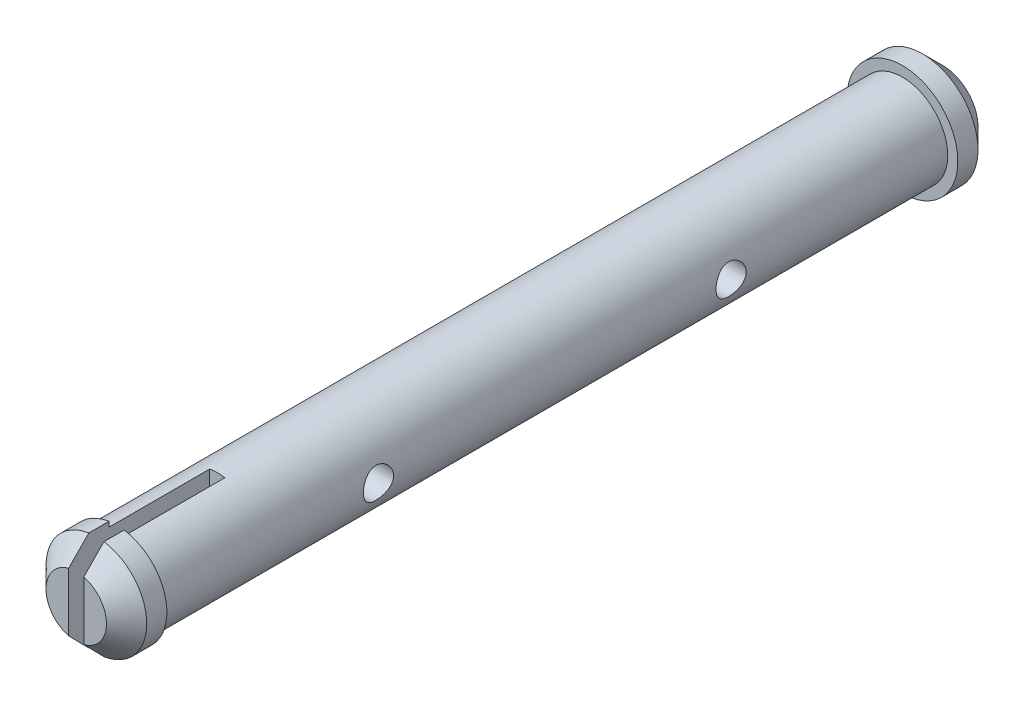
from build123d import *

# Parameters (mm, degrees)
CROQUIS1_R                 = 4.5
SALIENTE_EXTRUIR1_DEPTH    = 78
CROQUIS2_R                 = 5.5
SALIENTE_EXTRUIR2_DEPTH    = 4
CROQUIS3_R                 = 5
SALIENTE_EXTRUIR3_DEPTH    = 4
CROQUIS4_W                 = 1.5
CROQUIS4_H                 = 10.362879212
CORTAR_EXTRUIR1_DEPTH      = 14
CHAFL_N1_SIZE              = 2
CORTAR_EXTRUIR2_DEPTH      = 83.36807634
CORTAR_EXTRUIR2_DEPTH_BACK = 83.36807634
CROQUIS5_R                 = 1.5


with BuildPart() as part:
    # Croquis1 → Saliente-Extruir1 (new body)
    with BuildSketch(Plane.XY):
        Circle(CROQUIS1_R)
    extrude(amount=SALIENTE_EXTRUIR1_DEPTH)

    # Croquis2 → Saliente-Extruir2 (add)
    with BuildSketch(Plane(origin=(0, 0, 0), x_dir=(-1, 0, 0), z_dir=(0, 0, -1))):
        Circle(CROQUIS2_R)
    extrude(amount=SALIENTE_EXTRUIR2_DEPTH)

    # Croquis3 → Saliente-Extruir3 (add)
    with BuildSketch(Plane.XY.offset(78)):
        Circle(CROQUIS3_R)
    extrude(amount=SALIENTE_EXTRUIR3_DEPTH)

    # Croquis4 → Cortar-Extruir1 (cut)
    with BuildSketch(Plane.XY.offset(82)):
        with Locations((0, -0.064365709)):
            Rectangle(CROQUIS4_W, CROQUIS4_H)
    extrude(amount=-CORTAR_EXTRUIR1_DEPTH, mode=Mode.SUBTRACT)

    # Chafl_n1
    chafl_n1_edges = [part.edges().sort_by_distance(p)[0] for p in [
        (-5, 0, 82),
        (5, 0, 82),
        (5.5, 0, -4),
    ]]
    chamfer(chafl_n1_edges, length=CHAFL_N1_SIZE)

    # Croquis5 → Cortar-Extruir2 (cut, two sides: drawn at the far end of the back side and taken through both)
    with BuildSketch(Plane(origin=(0, 0, 0), x_dir=(0, 0, -1), z_dir=(1, 0, 0)).offset(-CORTAR_EXTRUIR2_DEPTH_BACK)):
        with Locations((-21.5, 0)):
            Circle(CROQUIS5_R)
        with Locations((-56.5, 0)):
            Circle(CROQUIS5_R)
    extrude(amount=CORTAR_EXTRUIR2_DEPTH + CORTAR_EXTRUIR2_DEPTH_BACK, mode=Mode.SUBTRACT)


solid = part.part
